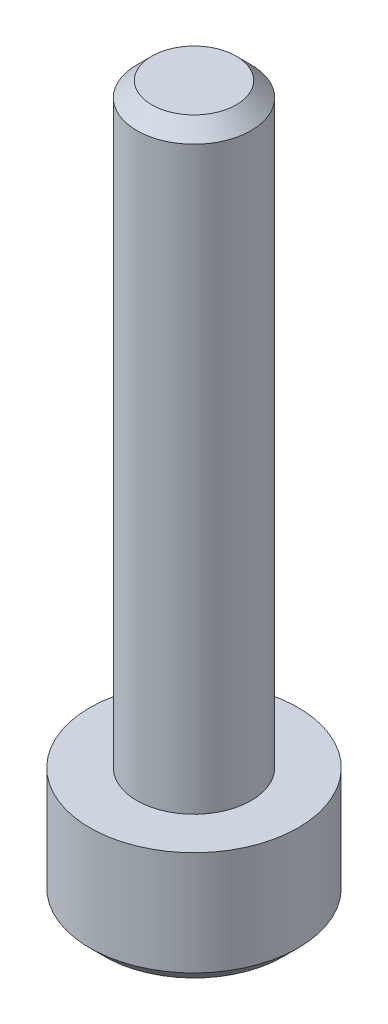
ISO-10303-21;
HEADER;
FILE_DESCRIPTION(('STEP AP214'),'2;1');
FILE_NAME('part.step','',(''),(''),'','','');
FILE_SCHEMA(('AUTOMOTIVE_DESIGN { 1 0 10303 214 1 1 1 1 }'));
ENDSEC;
DATA;
#1=APPLICATION_CONTEXT('core data for automotive mechanical design processes');
#2=APPLICATION_PROTOCOL_DEFINITION('international standard','automotive_design',2000,#1);
#3=PRODUCT_CONTEXT('',#1,'mechanical');
#4=PRODUCT('Part','Part','',(#3));
#5=PRODUCT_RELATED_PRODUCT_CATEGORY('part','',(#4));
#6=PRODUCT_DEFINITION_FORMATION('','',#4);
#7=PRODUCT_DEFINITION_CONTEXT('part definition',#1,'design');
#8=PRODUCT_DEFINITION('design','',#6,#7);
#9=PRODUCT_DEFINITION_SHAPE('','',#8);
#10=(LENGTH_UNIT() NAMED_UNIT(*) SI_UNIT(.MILLI.,.METRE.));
#11=(NAMED_UNIT(*) PLANE_ANGLE_UNIT() SI_UNIT($,.RADIAN.));
#12=(NAMED_UNIT(*) SI_UNIT($,.STERADIAN.) SOLID_ANGLE_UNIT());
#13=UNCERTAINTY_MEASURE_WITH_UNIT(LENGTH_MEASURE(1.E-05),#10,'distance_accuracy_value','');
#14=(GEOMETRIC_REPRESENTATION_CONTEXT(3) GLOBAL_UNCERTAINTY_ASSIGNED_CONTEXT((#13)) GLOBAL_UNIT_ASSIGNED_CONTEXT((#10,
#11,#12)) REPRESENTATION_CONTEXT('',''));
#15=CARTESIAN_POINT('',(0.,0.,0.));
#16=DIRECTION('',(0.,0.,1.));
#17=DIRECTION('',(1.,0.,0.));
#18=AXIS2_PLACEMENT_3D('',#15,#16,#17);
#19=CARTESIAN_POINT('',(-50.,-143.,8.));
#20=DIRECTION('',(0.,1.,0.));
#21=DIRECTION('',(1.,0.,0.));
#22=AXIS2_PLACEMENT_3D('',#19,#20,#21);
#23=PLANE('',#22);
#24=CARTESIAN_POINT('',(-50.,-143.,8.));
#25=DIRECTION('',(0.,1.,0.));
#26=DIRECTION('',(1.,0.,0.));
#27=AXIS2_PLACEMENT_3D('',#24,#25,#26);
#28=CIRCLE('',#27,1.919);
#29=CARTESIAN_POINT('',(-48.081,-143.,8.));
#30=VERTEX_POINT('',#29);
#31=EDGE_CURVE('E11',#30,#30,#28,.T.);
#32=ORIENTED_EDGE('',*,*,#31,.F.);
#33=EDGE_LOOP('',(#32));
#34=FACE_BOUND('',#33,.T.);
#35=CARTESIAN_POINT('',(-50.,-143.,8.));
#36=DIRECTION('',(0.,-1.,0.));
#37=DIRECTION('',(-1.,0.,0.));
#38=AXIS2_PLACEMENT_3D('',#35,#36,#37);
#39=CIRCLE('',#38,3.5);
#40=CARTESIAN_POINT('',(-53.5,-143.,8.));
#41=VERTEX_POINT('',#40);
#42=EDGE_CURVE('E103',#41,#41,#39,.T.);
#43=ORIENTED_EDGE('',*,*,#42,.F.);
#44=EDGE_LOOP('',(#43));
#45=FACE_BOUND('',#44,.T.);
#46=ADVANCED_FACE('F16',(#34,#45),#23,.T.);
#47=CARTESIAN_POINT('',(-50.,-147.,8.));
#48=DIRECTION('',(0.,-1.,0.));
#49=DIRECTION('',(-1.,0.,0.));
#50=AXIS2_PLACEMENT_3D('',#47,#48,#49);
#51=PLANE('',#50);
#52=CARTESIAN_POINT('',(-50.,-147.,8.));
#53=DIRECTION('',(0.,-1.,0.));
#54=DIRECTION('',(-1.,0.,0.));
#55=AXIS2_PLACEMENT_3D('',#52,#53,#54);
#56=CIRCLE('',#55,3.);
#57=CARTESIAN_POINT('',(-53.,-147.,8.));
#58=VERTEX_POINT('',#57);
#59=EDGE_CURVE('E20',#58,#58,#56,.T.);
#60=ORIENTED_EDGE('',*,*,#59,.T.);
#61=EDGE_LOOP('',(#60));
#62=FACE_BOUND('',#61,.T.);
#63=DIRECTION('',(-0.5,0.,-0.86602540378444));
#64=VECTOR('',#63,1.);
#65=CARTESIAN_POINT('',(-50.8660254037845,-147.,9.5));
#66=LINE('',#65,#64);
#67=CARTESIAN_POINT('',(-50.8660254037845,-147.,9.5));
#68=VERTEX_POINT('',#67);
#69=CARTESIAN_POINT('',(-51.7320508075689,-147.,8.));
#70=VERTEX_POINT('',#69);
#71=EDGE_CURVE('E209',#68,#70,#66,.T.);
#72=ORIENTED_EDGE('',*,*,#71,.F.);
#73=DIRECTION('',(-1.,0.,0.));
#74=VECTOR('',#73,1.);
#75=CARTESIAN_POINT('',(-49.1339745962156,-147.,9.5));
#76=LINE('',#75,#74);
#77=CARTESIAN_POINT('',(-49.1339745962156,-147.,9.5));
#78=VERTEX_POINT('',#77);
#79=EDGE_CURVE('E89',#78,#68,#76,.T.);
#80=ORIENTED_EDGE('',*,*,#79,.F.);
#81=DIRECTION('',(-0.5,0.,0.866025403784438));
#82=VECTOR('',#81,1.);
#83=CARTESIAN_POINT('',(-48.2679491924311,-147.,8.));
#84=LINE('',#83,#82);
#85=CARTESIAN_POINT('',(-48.2679491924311,-147.,8.));
#86=VERTEX_POINT('',#85);
#87=EDGE_CURVE('E32',#86,#78,#84,.T.);
#88=ORIENTED_EDGE('',*,*,#87,.F.);
#89=DIRECTION('',(0.5,0.,0.866025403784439));
#90=VECTOR('',#89,1.);
#91=CARTESIAN_POINT('',(-49.1339745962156,-147.,6.5));
#92=LINE('',#91,#90);
#93=CARTESIAN_POINT('',(-49.1339745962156,-147.,6.5));
#94=VERTEX_POINT('',#93);
#95=EDGE_CURVE('E67',#94,#86,#92,.T.);
#96=ORIENTED_EDGE('',*,*,#95,.F.);
#97=DIRECTION('',(1.,0.,0.));
#98=VECTOR('',#97,1.);
#99=CARTESIAN_POINT('',(-50.8660254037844,-147.,6.5));
#100=LINE('',#99,#98);
#101=CARTESIAN_POINT('',(-50.8660254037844,-147.,6.5));
#102=VERTEX_POINT('',#101);
#103=EDGE_CURVE('E77',#102,#94,#100,.T.);
#104=ORIENTED_EDGE('',*,*,#103,.F.);
#105=DIRECTION('',(0.5,0.,-0.866025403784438));
#106=VECTOR('',#105,1.);
#107=CARTESIAN_POINT('',(-51.7320508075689,-147.,8.));
#108=LINE('',#107,#106);
#109=EDGE_CURVE('E83',#70,#102,#108,.T.);
#110=ORIENTED_EDGE('',*,*,#109,.F.);
#111=EDGE_LOOP('',(#72,#80,#88,#96,#104,#110));
#112=FACE_BOUND('',#111,.T.);
#113=ADVANCED_FACE('F86',(#62,#112),#51,.T.);
#114=CARTESIAN_POINT('',(-50.,-147.,8.));
#115=DIRECTION('',(0.,1.,0.));
#116=DIRECTION('',(1.,0.,0.));
#117=AXIS2_PLACEMENT_3D('',#114,#115,#116);
#118=CYLINDRICAL_SURFACE('',#117,3.5);
#119=CARTESIAN_POINT('',(-50.,-146.5,8.));
#120=DIRECTION('',(0.,-1.,0.));
#121=DIRECTION('',(-1.,0.,0.));
#122=AXIS2_PLACEMENT_3D('',#119,#120,#121);
#123=CIRCLE('',#122,3.5);
#124=CARTESIAN_POINT('',(-53.5,-146.5,8.));
#125=VERTEX_POINT('',#124);
#126=EDGE_CURVE('E107',#125,#125,#123,.F.);
#127=ORIENTED_EDGE('',*,*,#126,.T.);
#128=EDGE_LOOP('',(#127));
#129=FACE_BOUND('',#128,.T.);
#130=ORIENTED_EDGE('',*,*,#42,.T.);
#131=EDGE_LOOP('',(#130));
#132=FACE_BOUND('',#131,.T.);
#133=ADVANCED_FACE('F136',(#129,#132),#118,.T.);
#134=CARTESIAN_POINT('',(-50.8660254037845,-145.,9.5));
#135=DIRECTION('',(-0.86602540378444,0.,0.5));
#136=DIRECTION('',(0.5,0.,0.86602540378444));
#137=AXIS2_PLACEMENT_3D('',#134,#135,#136);
#138=PLANE('',#137);
#139=ORIENTED_EDGE('',*,*,#71,.T.);
#140=DIRECTION('',(0.,-1.,0.));
#141=VECTOR('',#140,1.);
#142=CARTESIAN_POINT('',(-51.7320508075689,-145.,8.));
#143=LINE('',#142,#141);
#144=CARTESIAN_POINT('',(-51.7320508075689,-145.,8.));
#145=VERTEX_POINT('',#144);
#146=EDGE_CURVE('E101',#145,#70,#143,.T.);
#147=ORIENTED_EDGE('',*,*,#146,.F.);
#148=DIRECTION('',(-0.5,0.,-0.86602540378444));
#149=VECTOR('',#148,1.);
#150=CARTESIAN_POINT('',(-50.8660254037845,-145.,9.5));
#151=LINE('',#150,#149);
#152=CARTESIAN_POINT('',(-50.8660254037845,-145.,9.5));
#153=VERTEX_POINT('',#152);
#154=EDGE_CURVE('E95',#153,#145,#151,.T.);
#155=ORIENTED_EDGE('',*,*,#154,.F.);
#156=DIRECTION('',(0.,-1.,0.));
#157=VECTOR('',#156,1.);
#158=CARTESIAN_POINT('',(-50.8660254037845,-145.,9.5));
#159=LINE('',#158,#157);
#160=EDGE_CURVE('E98',#153,#68,#159,.T.);
#161=ORIENTED_EDGE('',*,*,#160,.T.);
#162=EDGE_LOOP('',(#139,#147,#155,#161));
#163=FACE_BOUND('',#162,.T.);
#164=ADVANCED_FACE('F142',(#163),#138,.F.);
#165=CARTESIAN_POINT('',(-51.7320508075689,-145.,8.));
#166=DIRECTION('',(-0.866025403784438,0.,-0.5));
#167=DIRECTION('',(-0.5,0.,0.866025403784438));
#168=AXIS2_PLACEMENT_3D('',#165,#166,#167);
#169=PLANE('',#168);
#170=ORIENTED_EDGE('',*,*,#109,.T.);
#171=DIRECTION('',(0.,-1.,0.));
#172=VECTOR('',#171,1.);
#173=CARTESIAN_POINT('',(-50.8660254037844,-145.,6.5));
#174=LINE('',#173,#172);
#175=CARTESIAN_POINT('',(-50.8660254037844,-145.,6.5));
#176=VERTEX_POINT('',#175);
#177=EDGE_CURVE('E73',#176,#102,#174,.T.);
#178=ORIENTED_EDGE('',*,*,#177,.F.);
#179=DIRECTION('',(0.5,0.,-0.866025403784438));
#180=VECTOR('',#179,1.);
#181=CARTESIAN_POINT('',(-51.7320508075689,-145.,8.));
#182=LINE('',#181,#180);
#183=EDGE_CURVE('E221',#145,#176,#182,.T.);
#184=ORIENTED_EDGE('',*,*,#183,.F.);
#185=ORIENTED_EDGE('',*,*,#146,.T.);
#186=EDGE_LOOP('',(#170,#178,#184,#185));
#187=FACE_BOUND('',#186,.T.);
#188=ADVANCED_FACE('F146',(#187),#169,.F.);
#189=CARTESIAN_POINT('',(-50.8660254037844,-145.,6.5));
#190=DIRECTION('',(0.,0.,-1.));
#191=DIRECTION('',(-1.,0.,0.));
#192=AXIS2_PLACEMENT_3D('',#189,#190,#191);
#193=PLANE('',#192);
#194=ORIENTED_EDGE('',*,*,#103,.T.);
#195=DIRECTION('',(0.,-1.,0.));
#196=VECTOR('',#195,1.);
#197=CARTESIAN_POINT('',(-49.1339745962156,-145.,6.5));
#198=LINE('',#197,#196);
#199=CARTESIAN_POINT('',(-49.1339745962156,-145.,6.5));
#200=VERTEX_POINT('',#199);
#201=EDGE_CURVE('E62',#200,#94,#198,.T.);
#202=ORIENTED_EDGE('',*,*,#201,.F.);
#203=DIRECTION('',(1.,0.,0.));
#204=VECTOR('',#203,1.);
#205=CARTESIAN_POINT('',(-50.8660254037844,-145.,6.5));
#206=LINE('',#205,#204);
#207=EDGE_CURVE('E224',#176,#200,#206,.T.);
#208=ORIENTED_EDGE('',*,*,#207,.F.);
#209=ORIENTED_EDGE('',*,*,#177,.T.);
#210=EDGE_LOOP('',(#194,#202,#208,#209));
#211=FACE_BOUND('',#210,.T.);
#212=ADVANCED_FACE('F78',(#211),#193,.F.);
#213=CARTESIAN_POINT('',(-49.1339745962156,-145.,6.5));
#214=DIRECTION('',(0.866025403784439,0.,-0.5));
#215=DIRECTION('',(-0.5,0.,-0.866025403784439));
#216=AXIS2_PLACEMENT_3D('',#213,#214,#215);
#217=PLANE('',#216);
#218=ORIENTED_EDGE('',*,*,#95,.T.);
#219=DIRECTION('',(0.,-1.,0.));
#220=VECTOR('',#219,1.);
#221=CARTESIAN_POINT('',(-48.2679491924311,-145.,8.));
#222=LINE('',#221,#220);
#223=CARTESIAN_POINT('',(-48.2679491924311,-145.,8.));
#224=VERTEX_POINT('',#223);
#225=EDGE_CURVE('E74',#224,#86,#222,.T.);
#226=ORIENTED_EDGE('',*,*,#225,.F.);
#227=DIRECTION('',(0.5,0.,0.866025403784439));
#228=VECTOR('',#227,1.);
#229=CARTESIAN_POINT('',(-49.1339745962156,-145.,6.5));
#230=LINE('',#229,#228);
#231=EDGE_CURVE('E70',#200,#224,#230,.T.);
#232=ORIENTED_EDGE('',*,*,#231,.F.);
#233=ORIENTED_EDGE('',*,*,#201,.T.);
#234=EDGE_LOOP('',(#218,#226,#232,#233));
#235=FACE_BOUND('',#234,.T.);
#236=ADVANCED_FACE('F64',(#235),#217,.F.);
#237=CARTESIAN_POINT('',(-48.2679491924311,-145.,8.));
#238=DIRECTION('',(0.866025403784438,0.,0.5));
#239=DIRECTION('',(0.5,0.,-0.866025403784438));
#240=AXIS2_PLACEMENT_3D('',#237,#238,#239);
#241=PLANE('',#240);
#242=ORIENTED_EDGE('',*,*,#87,.T.);
#243=DIRECTION('',(0.,-1.,0.));
#244=VECTOR('',#243,1.);
#245=CARTESIAN_POINT('',(-49.1339745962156,-145.,9.5));
#246=LINE('',#245,#244);
#247=CARTESIAN_POINT('',(-49.1339745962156,-145.,9.5));
#248=VERTEX_POINT('',#247);
#249=EDGE_CURVE('E96',#248,#78,#246,.T.);
#250=ORIENTED_EDGE('',*,*,#249,.F.);
#251=DIRECTION('',(-0.5,0.,0.866025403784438));
#252=VECTOR('',#251,1.);
#253=CARTESIAN_POINT('',(-48.2679491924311,-145.,8.));
#254=LINE('',#253,#252);
#255=EDGE_CURVE('E41',#224,#248,#254,.T.);
#256=ORIENTED_EDGE('',*,*,#255,.F.);
#257=ORIENTED_EDGE('',*,*,#225,.T.);
#258=EDGE_LOOP('',(#242,#250,#256,#257));
#259=FACE_BOUND('',#258,.T.);
#260=ADVANCED_FACE('F127',(#259),#241,.F.);
#261=CARTESIAN_POINT('',(-49.1339745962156,-145.,9.5));
#262=DIRECTION('',(0.,0.,1.));
#263=DIRECTION('',(1.,0.,0.));
#264=AXIS2_PLACEMENT_3D('',#261,#262,#263);
#265=PLANE('',#264);
#266=ORIENTED_EDGE('',*,*,#79,.T.);
#267=ORIENTED_EDGE('',*,*,#160,.F.);
#268=DIRECTION('',(-1.,0.,0.));
#269=VECTOR('',#268,1.);
#270=CARTESIAN_POINT('',(-49.1339745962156,-145.,9.5));
#271=LINE('',#270,#269);
#272=EDGE_CURVE('E105',#248,#153,#271,.T.);
#273=ORIENTED_EDGE('',*,*,#272,.F.);
#274=ORIENTED_EDGE('',*,*,#249,.T.);
#275=EDGE_LOOP('',(#266,#267,#273,#274));
#276=FACE_BOUND('',#275,.T.);
#277=ADVANCED_FACE('F118',(#276),#265,.F.);
#278=CARTESIAN_POINT('',(-50.,-146.5,8.));
#279=DIRECTION('',(0.,1.,0.));
#280=DIRECTION('',(1.,0.,0.));
#281=AXIS2_PLACEMENT_3D('',#278,#279,#280);
#282=CONICAL_SURFACE('',#281,3.5,0.785398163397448);
#283=ORIENTED_EDGE('',*,*,#59,.F.);
#284=EDGE_LOOP('',(#283));
#285=FACE_BOUND('',#284,.T.);
#286=ORIENTED_EDGE('',*,*,#126,.F.);
#287=EDGE_LOOP('',(#286));
#288=FACE_BOUND('',#287,.T.);
#289=ADVANCED_FACE('F18',(#285,#288),#282,.T.);
#290=CARTESIAN_POINT('',(-50.8660254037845,-145.,9.5));
#291=DIRECTION('',(-0.43301270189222,0.866025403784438,0.25));
#292=DIRECTION('',(0.894427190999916,0.447213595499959,0.));
#293=AXIS2_PLACEMENT_3D('',#290,#291,#292);
#294=PLANE('',#293);
#295=ORIENTED_EDGE('',*,*,#154,.T.);
#296=DIRECTION('',(-0.894427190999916,-0.447213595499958,0.));
#297=VECTOR('',#296,1.);
#298=CARTESIAN_POINT('',(-51.0392304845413,-144.653589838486,8.));
#299=LINE('',#298,#297);
#300=CARTESIAN_POINT('',(-50.,-144.133974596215,8.));
#301=VERTEX_POINT('',#300);
#302=EDGE_CURVE('E206',#301,#145,#299,.T.);
#303=ORIENTED_EDGE('',*,*,#302,.F.);
#304=DIRECTION('',(-0.447213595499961,-0.447213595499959,0.774596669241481));
#305=VECTOR('',#304,1.);
#306=CARTESIAN_POINT('',(-50.5196152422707,-144.653589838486,8.9));
#307=LINE('',#306,#305);
#308=EDGE_CURVE('E197',#301,#153,#307,.T.);
#309=ORIENTED_EDGE('',*,*,#308,.T.);
#310=EDGE_LOOP('',(#295,#303,#309));
#311=FACE_BOUND('',#310,.T.);
#312=ADVANCED_FACE('F117',(#311),#294,.F.);
#313=CARTESIAN_POINT('',(-51.7320508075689,-145.,8.));
#314=DIRECTION('',(-0.433012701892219,0.866025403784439,-0.25));
#315=DIRECTION('',(0.894427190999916,0.447213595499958,0.));
#316=AXIS2_PLACEMENT_3D('',#313,#314,#315);
#317=PLANE('',#316);
#318=ORIENTED_EDGE('',*,*,#183,.T.);
#319=DIRECTION('',(-0.447213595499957,-0.447213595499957,-0.774596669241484));
#320=VECTOR('',#319,1.);
#321=CARTESIAN_POINT('',(-50.5196152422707,-144.653589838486,7.1));
#322=LINE('',#321,#320);
#323=EDGE_CURVE('E210',#301,#176,#322,.T.);
#324=ORIENTED_EDGE('',*,*,#323,.F.);
#325=ORIENTED_EDGE('',*,*,#302,.T.);
#326=EDGE_LOOP('',(#318,#324,#325));
#327=FACE_BOUND('',#326,.T.);
#328=ADVANCED_FACE('F124',(#327),#317,.F.);
#329=CARTESIAN_POINT('',(-50.8660254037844,-145.,6.5));
#330=DIRECTION('',(0.,0.866025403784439,-0.5));
#331=DIRECTION('',(0.,0.5,0.866025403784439));
#332=AXIS2_PLACEMENT_3D('',#329,#330,#331);
#333=PLANE('',#332);
#334=ORIENTED_EDGE('',*,*,#207,.T.);
#335=DIRECTION('',(0.447213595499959,-0.447213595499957,-0.774596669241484));
#336=VECTOR('',#335,1.);
#337=CARTESIAN_POINT('',(-49.4803847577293,-144.653589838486,7.1));
#338=LINE('',#337,#336);
#339=EDGE_CURVE('E213',#301,#200,#338,.T.);
#340=ORIENTED_EDGE('',*,*,#339,.F.);
#341=ORIENTED_EDGE('',*,*,#323,.T.);
#342=EDGE_LOOP('',(#334,#340,#341));
#343=FACE_BOUND('',#342,.T.);
#344=ADVANCED_FACE('F174',(#343),#333,.F.);
#345=CARTESIAN_POINT('',(-49.1339745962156,-145.,6.5));
#346=DIRECTION('',(0.43301270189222,0.866025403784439,-0.25));
#347=DIRECTION('',(0.894427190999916,-0.447213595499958,0.));
#348=AXIS2_PLACEMENT_3D('',#345,#346,#347);
#349=PLANE('',#348);
#350=ORIENTED_EDGE('',*,*,#231,.T.);
#351=DIRECTION('',(0.894427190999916,-0.447213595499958,0.));
#352=VECTOR('',#351,1.);
#353=CARTESIAN_POINT('',(-48.9607695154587,-144.653589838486,8.));
#354=LINE('',#353,#352);
#355=EDGE_CURVE('E216',#301,#224,#354,.T.);
#356=ORIENTED_EDGE('',*,*,#355,.F.);
#357=ORIENTED_EDGE('',*,*,#339,.T.);
#358=EDGE_LOOP('',(#350,#356,#357));
#359=FACE_BOUND('',#358,.T.);
#360=ADVANCED_FACE('F171',(#359),#349,.F.);
#361=CARTESIAN_POINT('',(-48.2679491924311,-145.,8.));
#362=DIRECTION('',(0.433012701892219,0.866025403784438,0.25));
#363=DIRECTION('',(0.894427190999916,-0.447213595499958,0.));
#364=AXIS2_PLACEMENT_3D('',#361,#362,#363);
#365=PLANE('',#364);
#366=ORIENTED_EDGE('',*,*,#255,.T.);
#367=DIRECTION('',(0.447213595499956,-0.447213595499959,0.774596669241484));
#368=VECTOR('',#367,1.);
#369=CARTESIAN_POINT('',(-49.4803847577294,-144.653589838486,8.9));
#370=LINE('',#369,#368);
#371=EDGE_CURVE('E201',#301,#248,#370,.T.);
#372=ORIENTED_EDGE('',*,*,#371,.F.);
#373=ORIENTED_EDGE('',*,*,#355,.T.);
#374=EDGE_LOOP('',(#366,#372,#373));
#375=FACE_BOUND('',#374,.T.);
#376=ADVANCED_FACE('F167',(#375),#365,.F.);
#377=CARTESIAN_POINT('',(-49.1339745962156,-145.,9.5));
#378=DIRECTION('',(0.,0.866025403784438,0.5));
#379=DIRECTION('',(0.,-0.5,0.866025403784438));
#380=AXIS2_PLACEMENT_3D('',#377,#378,#379);
#381=PLANE('',#380);
#382=ORIENTED_EDGE('',*,*,#272,.T.);
#383=ORIENTED_EDGE('',*,*,#308,.F.);
#384=ORIENTED_EDGE('',*,*,#371,.T.);
#385=EDGE_LOOP('',(#382,#383,#384));
#386=FACE_BOUND('',#385,.T.);
#387=ADVANCED_FACE('F163',(#386),#381,.F.);
#388=CARTESIAN_POINT('',(-50.,-123.,8.));
#389=DIRECTION('',(0.,1.,0.));
#390=DIRECTION('',(1.,0.,0.));
#391=AXIS2_PLACEMENT_3D('',#388,#389,#390);
#392=PLANE('',#391);
#393=CARTESIAN_POINT('',(-50.,-123.,8.));
#394=DIRECTION('',(0.,1.,0.));
#395=DIRECTION('',(1.,0.,0.));
#396=AXIS2_PLACEMENT_3D('',#393,#394,#395);
#397=CIRCLE('',#396,1.419);
#398=CARTESIAN_POINT('',(-48.581,-123.,8.));
#399=VERTEX_POINT('',#398);
#400=EDGE_CURVE('E196',#399,#399,#397,.T.);
#401=ORIENTED_EDGE('',*,*,#400,.T.);
#402=EDGE_LOOP('',(#401));
#403=FACE_BOUND('',#402,.T.);
#404=ADVANCED_FACE('F166',(#403),#392,.T.);
#405=CARTESIAN_POINT('',(-50.,-143.,8.));
#406=DIRECTION('',(0.,1.,0.));
#407=DIRECTION('',(1.,0.,0.));
#408=AXIS2_PLACEMENT_3D('',#405,#406,#407);
#409=CYLINDRICAL_SURFACE('',#408,1.919);
#410=CARTESIAN_POINT('',(-50.,-123.5,8.));
#411=DIRECTION('',(0.,1.,0.));
#412=DIRECTION('',(1.,0.,0.));
#413=AXIS2_PLACEMENT_3D('',#410,#411,#412);
#414=CIRCLE('',#413,1.919);
#415=CARTESIAN_POINT('',(-48.081,-123.5,8.));
#416=VERTEX_POINT('',#415);
#417=EDGE_CURVE('E198',#416,#416,#414,.F.);
#418=ORIENTED_EDGE('',*,*,#417,.T.);
#419=EDGE_LOOP('',(#418));
#420=FACE_BOUND('',#419,.T.);
#421=ORIENTED_EDGE('',*,*,#31,.T.);
#422=EDGE_LOOP('',(#421));
#423=FACE_BOUND('',#422,.T.);
#424=ADVANCED_FACE('F185',(#420,#423),#409,.T.);
#425=CARTESIAN_POINT('',(-50.,-123.5,8.));
#426=DIRECTION('',(0.,-1.,0.));
#427=DIRECTION('',(-1.,0.,0.));
#428=AXIS2_PLACEMENT_3D('',#425,#426,#427);
#429=CONICAL_SURFACE('',#428,1.919,0.785398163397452);
#430=ORIENTED_EDGE('',*,*,#400,.F.);
#431=EDGE_LOOP('',(#430));
#432=FACE_BOUND('',#431,.T.);
#433=ORIENTED_EDGE('',*,*,#417,.F.);
#434=EDGE_LOOP('',(#433));
#435=FACE_BOUND('',#434,.T.);
#436=ADVANCED_FACE('F182',(#432,#435),#429,.T.);
#437=CLOSED_SHELL('',(#46,#113,#133,#164,#188,#212,#236,#260,#277,#289,#312,#328,#344,#360,#376,
#387,#404,#424,#436));
#438=MANIFOLD_SOLID_BREP('B1',#437);
#439=ADVANCED_BREP_SHAPE_REPRESENTATION('',(#18,#438),#14);
#440=SHAPE_DEFINITION_REPRESENTATION(#9,#439);
ENDSEC;
END-ISO-10303-21;
